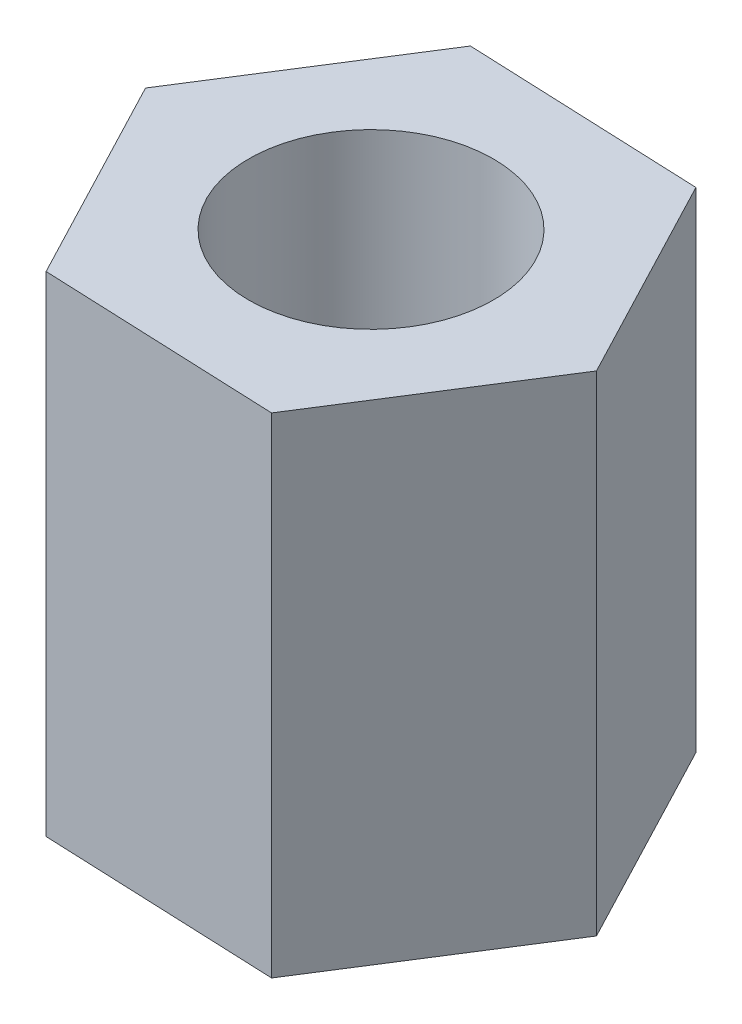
ISO-10303-21;
HEADER;
FILE_DESCRIPTION(('STEP AP214'),'2;1');
FILE_NAME('part.step','',(''),(''),'','','');
FILE_SCHEMA(('AUTOMOTIVE_DESIGN { 1 0 10303 214 1 1 1 1 }'));
ENDSEC;
DATA;
#1=APPLICATION_CONTEXT('core data for automotive mechanical design processes');
#2=APPLICATION_PROTOCOL_DEFINITION('international standard','automotive_design',2000,#1);
#3=PRODUCT_CONTEXT('',#1,'mechanical');
#4=PRODUCT('Part','Part','',(#3));
#5=PRODUCT_RELATED_PRODUCT_CATEGORY('part','',(#4));
#6=PRODUCT_DEFINITION_FORMATION('','',#4);
#7=PRODUCT_DEFINITION_CONTEXT('part definition',#1,'design');
#8=PRODUCT_DEFINITION('design','',#6,#7);
#9=PRODUCT_DEFINITION_SHAPE('','',#8);
#10=(LENGTH_UNIT() NAMED_UNIT(*) SI_UNIT(.MILLI.,.METRE.));
#11=(NAMED_UNIT(*) PLANE_ANGLE_UNIT() SI_UNIT($,.RADIAN.));
#12=(NAMED_UNIT(*) SI_UNIT($,.STERADIAN.) SOLID_ANGLE_UNIT());
#13=UNCERTAINTY_MEASURE_WITH_UNIT(LENGTH_MEASURE(1.E-05),#10,'distance_accuracy_value','');
#14=(GEOMETRIC_REPRESENTATION_CONTEXT(3) GLOBAL_UNCERTAINTY_ASSIGNED_CONTEXT((#13)) GLOBAL_UNIT_ASSIGNED_CONTEXT((#10,
#11,#12)) REPRESENTATION_CONTEXT('',''));
#15=CARTESIAN_POINT('',(0.,0.,0.));
#16=DIRECTION('',(0.,0.,1.));
#17=DIRECTION('',(1.,0.,0.));
#18=AXIS2_PLACEMENT_3D('',#15,#16,#17);
#19=CARTESIAN_POINT('',(0.,6.,0.));
#20=DIRECTION('',(0.,1.,0.));
#21=DIRECTION('',(0.,0.,1.));
#22=AXIS2_PLACEMENT_3D('',#19,#20,#21);
#23=PLANE('',#22);
#24=DIRECTION('',(0.999140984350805,0.,0.0414402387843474));
#25=VECTOR('',#24,1.);
#26=CARTESIAN_POINT('',(-1.54573638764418,6.,2.43803862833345));
#27=LINE('',#26,#25);
#28=CARTESIAN_POINT('',(-1.54573638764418,6.,2.43803862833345));
#29=VERTEX_POINT('',#28);
#30=CARTESIAN_POINT('',(1.33853519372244,6.,2.55766629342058));
#31=VERTEX_POINT('',#30);
#32=EDGE_CURVE('E152',#29,#31,#27,.T.);
#33=ORIENTED_EDGE('',*,*,#32,.T.);
#34=DIRECTION('',(0.535458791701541,0.,-0.844561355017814));
#35=VECTOR('',#34,1.);
#36=CARTESIAN_POINT('',(1.33853519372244,6.,2.55766629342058));
#37=LINE('',#36,#35);
#38=CARTESIAN_POINT('',(2.88427158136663,6.,0.119627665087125));
#39=VERTEX_POINT('',#38);
#40=EDGE_CURVE('E100',#31,#39,#37,.T.);
#41=ORIENTED_EDGE('',*,*,#40,.T.);
#42=DIRECTION('',(-0.463682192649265,0.,-0.886001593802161));
#43=VECTOR('',#42,1.);
#44=CARTESIAN_POINT('',(2.88427158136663,6.,0.119627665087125));
#45=LINE('',#44,#43);
#46=CARTESIAN_POINT('',(1.54573638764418,6.,-2.43803862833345));
#47=VERTEX_POINT('',#46);
#48=EDGE_CURVE('E113',#39,#47,#45,.T.);
#49=ORIENTED_EDGE('',*,*,#48,.T.);
#50=DIRECTION('',(-0.999140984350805,0.,-0.0414402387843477));
#51=VECTOR('',#50,1.);
#52=CARTESIAN_POINT('',(1.54573638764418,6.,-2.43803862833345));
#53=LINE('',#52,#51);
#54=CARTESIAN_POINT('',(-1.33853519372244,6.,-2.55766629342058));
#55=VERTEX_POINT('',#54);
#56=EDGE_CURVE('E107',#47,#55,#53,.T.);
#57=ORIENTED_EDGE('',*,*,#56,.T.);
#58=DIRECTION('',(-0.53545879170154,0.,0.844561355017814));
#59=VECTOR('',#58,1.);
#60=CARTESIAN_POINT('',(-1.33853519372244,6.,-2.55766629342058));
#61=LINE('',#60,#59);
#62=CARTESIAN_POINT('',(-2.88427158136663,6.,-0.119627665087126));
#63=VERTEX_POINT('',#62);
#64=EDGE_CURVE('E111',#55,#63,#61,.T.);
#65=ORIENTED_EDGE('',*,*,#64,.T.);
#66=DIRECTION('',(0.463682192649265,0.,0.886001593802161));
#67=VECTOR('',#66,1.);
#68=CARTESIAN_POINT('',(-2.88427158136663,6.,-0.119627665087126));
#69=LINE('',#68,#67);
#70=EDGE_CURVE('E63',#63,#29,#69,.T.);
#71=ORIENTED_EDGE('',*,*,#70,.T.);
#72=EDGE_LOOP('',(#33,#41,#49,#57,#65,#71));
#73=FACE_BOUND('',#72,.T.);
#74=CARTESIAN_POINT('',(0.,6.,0.));
#75=DIRECTION('',(0.,1.,0.));
#76=DIRECTION('',(0.,0.,1.));
#77=AXIS2_PLACEMENT_3D('',#74,#75,#76);
#78=CIRCLE('',#77,1.5);
#79=CARTESIAN_POINT('',(0.,6.,1.5));
#80=VERTEX_POINT('',#79);
#81=EDGE_CURVE('E140',#80,#80,#78,.T.);
#82=ORIENTED_EDGE('',*,*,#81,.F.);
#83=EDGE_LOOP('',(#82));
#84=FACE_BOUND('',#83,.T.);
#85=ADVANCED_FACE('F45',(#73,#84),#23,.T.);
#86=CARTESIAN_POINT('',(0.,0.,0.));
#87=DIRECTION('',(0.,1.,0.));
#88=DIRECTION('',(0.,0.,1.));
#89=AXIS2_PLACEMENT_3D('',#86,#87,#88);
#90=PLANE('',#89);
#91=DIRECTION('',(0.999140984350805,0.,0.0414402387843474));
#92=VECTOR('',#91,1.);
#93=CARTESIAN_POINT('',(-1.54573638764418,0.,2.43803862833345));
#94=LINE('',#93,#92);
#95=CARTESIAN_POINT('',(-1.54573638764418,0.,2.43803862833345));
#96=VERTEX_POINT('',#95);
#97=CARTESIAN_POINT('',(1.33853519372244,0.,2.55766629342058));
#98=VERTEX_POINT('',#97);
#99=EDGE_CURVE('E135',#96,#98,#94,.T.);
#100=ORIENTED_EDGE('',*,*,#99,.F.);
#101=DIRECTION('',(0.463682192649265,0.,0.886001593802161));
#102=VECTOR('',#101,1.);
#103=CARTESIAN_POINT('',(-2.88427158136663,0.,-0.119627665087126));
#104=LINE('',#103,#102);
#105=CARTESIAN_POINT('',(-2.88427158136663,0.,-0.119627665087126));
#106=VERTEX_POINT('',#105);
#107=EDGE_CURVE('E92',#106,#96,#104,.T.);
#108=ORIENTED_EDGE('',*,*,#107,.F.);
#109=DIRECTION('',(-0.53545879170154,0.,0.844561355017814));
#110=VECTOR('',#109,1.);
#111=CARTESIAN_POINT('',(-1.33853519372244,0.,-2.55766629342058));
#112=LINE('',#111,#110);
#113=CARTESIAN_POINT('',(-1.33853519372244,0.,-2.55766629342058));
#114=VERTEX_POINT('',#113);
#115=EDGE_CURVE('E86',#114,#106,#112,.T.);
#116=ORIENTED_EDGE('',*,*,#115,.F.);
#117=DIRECTION('',(-0.999140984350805,0.,-0.0414402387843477));
#118=VECTOR('',#117,1.);
#119=CARTESIAN_POINT('',(1.54573638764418,0.,-2.43803862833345));
#120=LINE('',#119,#118);
#121=CARTESIAN_POINT('',(1.54573638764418,0.,-2.43803862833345));
#122=VERTEX_POINT('',#121);
#123=EDGE_CURVE('E122',#122,#114,#120,.T.);
#124=ORIENTED_EDGE('',*,*,#123,.F.);
#125=DIRECTION('',(-0.463682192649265,0.,-0.886001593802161));
#126=VECTOR('',#125,1.);
#127=CARTESIAN_POINT('',(2.88427158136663,0.,0.119627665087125));
#128=LINE('',#127,#126);
#129=CARTESIAN_POINT('',(2.88427158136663,0.,0.119627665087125));
#130=VERTEX_POINT('',#129);
#131=EDGE_CURVE('E143',#130,#122,#128,.T.);
#132=ORIENTED_EDGE('',*,*,#131,.F.);
#133=DIRECTION('',(0.535458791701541,0.,-0.844561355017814));
#134=VECTOR('',#133,1.);
#135=CARTESIAN_POINT('',(1.33853519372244,0.,2.55766629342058));
#136=LINE('',#135,#134);
#137=EDGE_CURVE('E139',#98,#130,#136,.T.);
#138=ORIENTED_EDGE('',*,*,#137,.F.);
#139=EDGE_LOOP('',(#100,#108,#116,#124,#132,#138));
#140=FACE_BOUND('',#139,.T.);
#141=CARTESIAN_POINT('',(0.,0.,0.));
#142=DIRECTION('',(0.,1.,0.));
#143=DIRECTION('',(0.,0.,1.));
#144=AXIS2_PLACEMENT_3D('',#141,#142,#143);
#145=CIRCLE('',#144,1.5);
#146=CARTESIAN_POINT('',(0.,0.,1.5));
#147=VERTEX_POINT('',#146);
#148=EDGE_CURVE('E249',#147,#147,#145,.T.);
#149=ORIENTED_EDGE('',*,*,#148,.T.);
#150=EDGE_LOOP('',(#149));
#151=FACE_BOUND('',#150,.T.);
#152=ADVANCED_FACE('F165',(#140,#151),#90,.F.);
#153=CARTESIAN_POINT('',(-1.54573638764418,6.,2.43803862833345));
#154=DIRECTION('',(0.0414402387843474,0.,-0.999140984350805));
#155=DIRECTION('',(-0.999140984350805,0.,-0.0414402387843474));
#156=AXIS2_PLACEMENT_3D('',#153,#154,#155);
#157=PLANE('',#156);
#158=ORIENTED_EDGE('',*,*,#99,.T.);
#159=DIRECTION('',(0.,-1.,0.));
#160=VECTOR('',#159,1.);
#161=CARTESIAN_POINT('',(1.33853519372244,6.,2.55766629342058));
#162=LINE('',#161,#160);
#163=EDGE_CURVE('E11',#31,#98,#162,.T.);
#164=ORIENTED_EDGE('',*,*,#163,.F.);
#165=ORIENTED_EDGE('',*,*,#32,.F.);
#166=DIRECTION('',(0.,-1.,0.));
#167=VECTOR('',#166,1.);
#168=CARTESIAN_POINT('',(-1.54573638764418,6.,2.43803862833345));
#169=LINE('',#168,#167);
#170=EDGE_CURVE('E131',#29,#96,#169,.T.);
#171=ORIENTED_EDGE('',*,*,#170,.T.);
#172=EDGE_LOOP('',(#158,#164,#165,#171));
#173=FACE_BOUND('',#172,.T.);
#174=ADVANCED_FACE('F47',(#173),#157,.F.);
#175=CARTESIAN_POINT('',(1.33853519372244,6.,2.55766629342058));
#176=DIRECTION('',(-0.844561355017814,0.,-0.535458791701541));
#177=DIRECTION('',(-0.535458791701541,0.,0.844561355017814));
#178=AXIS2_PLACEMENT_3D('',#175,#176,#177);
#179=PLANE('',#178);
#180=ORIENTED_EDGE('',*,*,#137,.T.);
#181=DIRECTION('',(0.,-1.,0.));
#182=VECTOR('',#181,1.);
#183=CARTESIAN_POINT('',(2.88427158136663,6.,0.119627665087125));
#184=LINE('',#183,#182);
#185=EDGE_CURVE('E55',#39,#130,#184,.T.);
#186=ORIENTED_EDGE('',*,*,#185,.F.);
#187=ORIENTED_EDGE('',*,*,#40,.F.);
#188=ORIENTED_EDGE('',*,*,#163,.T.);
#189=EDGE_LOOP('',(#180,#186,#187,#188));
#190=FACE_BOUND('',#189,.T.);
#191=ADVANCED_FACE('F190',(#190),#179,.F.);
#192=CARTESIAN_POINT('',(2.88427158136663,6.,0.119627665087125));
#193=DIRECTION('',(-0.886001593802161,0.,0.463682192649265));
#194=DIRECTION('',(0.463682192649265,0.,0.886001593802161));
#195=AXIS2_PLACEMENT_3D('',#192,#193,#194);
#196=PLANE('',#195);
#197=ORIENTED_EDGE('',*,*,#131,.T.);
#198=DIRECTION('',(0.,-1.,0.));
#199=VECTOR('',#198,1.);
#200=CARTESIAN_POINT('',(1.54573638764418,6.,-2.43803862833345));
#201=LINE('',#200,#199);
#202=EDGE_CURVE('E124',#47,#122,#201,.T.);
#203=ORIENTED_EDGE('',*,*,#202,.F.);
#204=ORIENTED_EDGE('',*,*,#48,.F.);
#205=ORIENTED_EDGE('',*,*,#185,.T.);
#206=EDGE_LOOP('',(#197,#203,#204,#205));
#207=FACE_BOUND('',#206,.T.);
#208=ADVANCED_FACE('F162',(#207),#196,.F.);
#209=CARTESIAN_POINT('',(1.54573638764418,6.,-2.43803862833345));
#210=DIRECTION('',(-0.0414402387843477,0.,0.999140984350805));
#211=DIRECTION('',(0.999140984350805,0.,0.0414402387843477));
#212=AXIS2_PLACEMENT_3D('',#209,#210,#211);
#213=PLANE('',#212);
#214=ORIENTED_EDGE('',*,*,#123,.T.);
#215=DIRECTION('',(0.,-1.,0.));
#216=VECTOR('',#215,1.);
#217=CARTESIAN_POINT('',(-1.33853519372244,6.,-2.55766629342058));
#218=LINE('',#217,#216);
#219=EDGE_CURVE('E119',#55,#114,#218,.T.);
#220=ORIENTED_EDGE('',*,*,#219,.F.);
#221=ORIENTED_EDGE('',*,*,#56,.F.);
#222=ORIENTED_EDGE('',*,*,#202,.T.);
#223=EDGE_LOOP('',(#214,#220,#221,#222));
#224=FACE_BOUND('',#223,.T.);
#225=ADVANCED_FACE('F120',(#224),#213,.F.);
#226=CARTESIAN_POINT('',(-1.33853519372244,6.,-2.55766629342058));
#227=DIRECTION('',(0.844561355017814,0.,0.535458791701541));
#228=DIRECTION('',(0.535458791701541,0.,-0.844561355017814));
#229=AXIS2_PLACEMENT_3D('',#226,#227,#228);
#230=PLANE('',#229);
#231=ORIENTED_EDGE('',*,*,#115,.T.);
#232=DIRECTION('',(0.,-1.,0.));
#233=VECTOR('',#232,1.);
#234=CARTESIAN_POINT('',(-2.88427158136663,6.,-0.119627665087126));
#235=LINE('',#234,#233);
#236=EDGE_CURVE('E125',#63,#106,#235,.T.);
#237=ORIENTED_EDGE('',*,*,#236,.F.);
#238=ORIENTED_EDGE('',*,*,#64,.F.);
#239=ORIENTED_EDGE('',*,*,#219,.T.);
#240=EDGE_LOOP('',(#231,#237,#238,#239));
#241=FACE_BOUND('',#240,.T.);
#242=ADVANCED_FACE('F127',(#241),#230,.F.);
#243=CARTESIAN_POINT('',(-2.88427158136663,6.,-0.119627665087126));
#244=DIRECTION('',(0.886001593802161,0.,-0.463682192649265));
#245=DIRECTION('',(-0.463682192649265,0.,-0.886001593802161));
#246=AXIS2_PLACEMENT_3D('',#243,#244,#245);
#247=PLANE('',#246);
#248=ORIENTED_EDGE('',*,*,#107,.T.);
#249=ORIENTED_EDGE('',*,*,#170,.F.);
#250=ORIENTED_EDGE('',*,*,#70,.F.);
#251=ORIENTED_EDGE('',*,*,#236,.T.);
#252=EDGE_LOOP('',(#248,#249,#250,#251));
#253=FACE_BOUND('',#252,.T.);
#254=ADVANCED_FACE('F170',(#253),#247,.F.);
#255=CARTESIAN_POINT('',(0.,6.,0.));
#256=DIRECTION('',(0.,-1.,0.));
#257=DIRECTION('',(0.,0.,-1.));
#258=AXIS2_PLACEMENT_3D('',#255,#256,#257);
#259=CYLINDRICAL_SURFACE('',#258,1.5);
#260=ORIENTED_EDGE('',*,*,#81,.T.);
#261=EDGE_LOOP('',(#260));
#262=FACE_BOUND('',#261,.T.);
#263=ORIENTED_EDGE('',*,*,#148,.F.);
#264=EDGE_LOOP('',(#263));
#265=FACE_BOUND('',#264,.T.);
#266=ADVANCED_FACE('F172',(#262,#265),#259,.F.);
#267=CLOSED_SHELL('',(#85,#152,#174,#191,#208,#225,#242,#254,#266));
#268=MANIFOLD_SOLID_BREP('B2',#267);
#269=ADVANCED_BREP_SHAPE_REPRESENTATION('',(#18,#268),#14);
#270=SHAPE_DEFINITION_REPRESENTATION(#9,#269);
ENDSEC;
END-ISO-10303-21;
